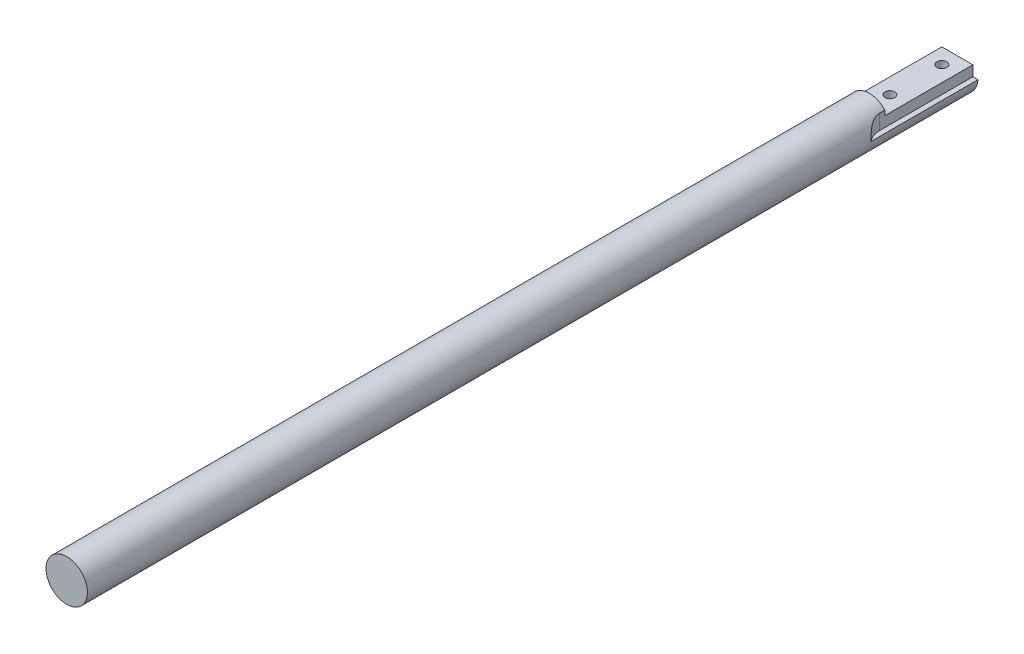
from build123d import *

# Parameters (mm, degrees)
SKETCH1_R             = 3.175
EXTRUDE1_DEPTH        = 136.525
CUT_EXTRUDE1_DEPTH    = 13.49375
CUT_EXTRUDE2_DEPTH    = 137.603573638
F_0_80_TAPPED_HOLE1_D = 1.524


with BuildPart() as part:
    # Sketch1 → Extrude1 (new body)
    with BuildSketch(Plane(origin=(0, 0, 0), x_dir=(-1, 0, 0), z_dir=(0, 0, -1))):
        Circle(SKETCH1_R)
    extrude(amount=-EXTRUDE1_DEPTH)

    # Sketch3 → Cut-Extrude1 (cut)
    with BuildSketch(Plane(origin=(0, 0, 0), x_dir=(-1, 0, 0), z_dir=(0, 0, -1))):
        Polygon((4.8895, -0.1984375), (2.38125, -0.1984375), (2.38125, 1.3890625), (-2.38125, 1.3890625), (-2.38125, -0.1984375), (-4.6355, -0.1984375), (-4.6355, 4.5640625), (4.8895, 4.5640625), align=None)
    extrude(amount=-CUT_EXTRUDE1_DEPTH, mode=Mode.SUBTRACT)

    # Sketch4 → Cut-Extrude2 (cut, through all)
    with BuildSketch(Plane(origin=(0, -0.1984375, 0), x_dir=(-1, 0, 0), z_dir=(0, 1, 0))):
        with BuildLine():
            Line((-2.38125, 11.1125), (-8.73125, 11.1125))
            Line((-8.73125, 11.1125), (-8.73125, 17.4625))
            Line((-8.73125, 17.4625), (-5.55625, 17.4625))
            ThreePointArc((-5.55625, 17.4625), (-3.31118597, 16.53256403), (-2.38125, 14.2875))
            Line((-2.38125, 14.2875), (-2.38125, 11.1125))
        make_face()
        with BuildLine():
            Line((8.73125, 11.1125), (8.73125, 17.4625))
            Line((8.73125, 17.4625), (5.55625, 17.4625))
            ThreePointArc((5.55625, 17.4625), (3.31118597, 16.53256403), (2.38125, 14.2875))
            Line((2.38125, 14.2875), (2.38125, 11.1125))
            Line((2.38125, 11.1125), (8.73125, 11.1125))
        make_face()
    extrude(amount=CUT_EXTRUDE2_DEPTH, mode=Mode.SUBTRACT)

    # 0-80 Tapped Hole1 (through all)
    with Locations(Plane(origin=(0, 1.3890625, 0), x_dir=(-1, 0, 0), z_dir=(0, 1, 0))):
        with Locations((0.003634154, 10.3378), (0.015904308, 2.3622)):
            Hole(F_0_80_TAPPED_HOLE1_D / 2)


solid = part.part
